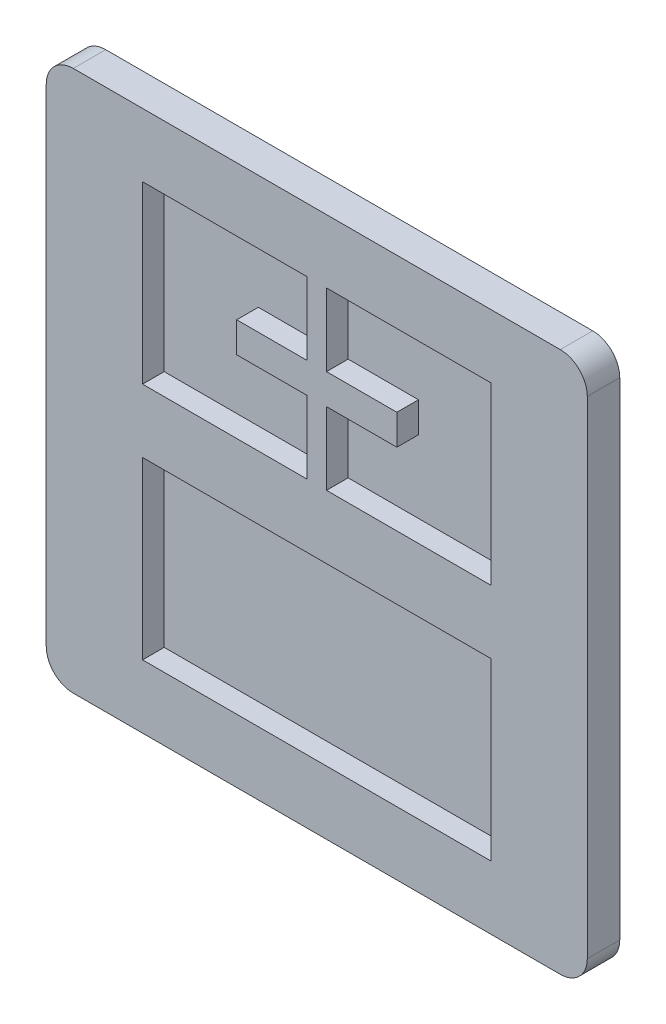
ISO-10303-21;
HEADER;
FILE_DESCRIPTION(('STEP AP214'),'2;1');
FILE_NAME('part.step','',(''),(''),'','','');
FILE_SCHEMA(('AUTOMOTIVE_DESIGN { 1 0 10303 214 1 1 1 1 }'));
ENDSEC;
DATA;
#1=APPLICATION_CONTEXT('core data for automotive mechanical design processes');
#2=APPLICATION_PROTOCOL_DEFINITION('international standard','automotive_design',2000,#1);
#3=PRODUCT_CONTEXT('',#1,'mechanical');
#4=PRODUCT('Part','Part','',(#3));
#5=PRODUCT_RELATED_PRODUCT_CATEGORY('part','',(#4));
#6=PRODUCT_DEFINITION_FORMATION('','',#4);
#7=PRODUCT_DEFINITION_CONTEXT('part definition',#1,'design');
#8=PRODUCT_DEFINITION('design','',#6,#7);
#9=PRODUCT_DEFINITION_SHAPE('','',#8);
#10=(LENGTH_UNIT() NAMED_UNIT(*) SI_UNIT(.MILLI.,.METRE.));
#11=(NAMED_UNIT(*) PLANE_ANGLE_UNIT() SI_UNIT($,.RADIAN.));
#12=(NAMED_UNIT(*) SI_UNIT($,.STERADIAN.) SOLID_ANGLE_UNIT());
#13=UNCERTAINTY_MEASURE_WITH_UNIT(LENGTH_MEASURE(1.E-05),#10,'distance_accuracy_value','');
#14=(GEOMETRIC_REPRESENTATION_CONTEXT(3) GLOBAL_UNCERTAINTY_ASSIGNED_CONTEXT((#13)) GLOBAL_UNIT_ASSIGNED_CONTEXT((#10,
#11,#12)) REPRESENTATION_CONTEXT('',''));
#15=CARTESIAN_POINT('',(0.,0.,0.));
#16=DIRECTION('',(0.,0.,1.));
#17=DIRECTION('',(1.,0.,0.));
#18=AXIS2_PLACEMENT_3D('',#15,#16,#17);
#19=CARTESIAN_POINT('',(50.,-50.,2.));
#20=DIRECTION('',(-1.,0.,0.));
#21=DIRECTION('',(0.,0.,1.));
#22=AXIS2_PLACEMENT_3D('',#19,#20,#21);
#23=PLANE('',#22);
#24=DIRECTION('',(0.,1.,0.));
#25=VECTOR('',#24,1.);
#26=CARTESIAN_POINT('',(50.,0.,6.));
#27=LINE('',#26,#25);
#28=CARTESIAN_POINT('',(50.,-45.,6.));
#29=VERTEX_POINT('',#28);
#30=CARTESIAN_POINT('',(50.,45.,6.));
#31=VERTEX_POINT('',#30);
#32=EDGE_CURVE('E259',#29,#31,#27,.T.);
#33=ORIENTED_EDGE('',*,*,#32,.F.);
#34=DIRECTION('',(0.,0.,-1.));
#35=VECTOR('',#34,1.);
#36=CARTESIAN_POINT('',(50.,-45.,2.));
#37=LINE('',#36,#35);
#38=CARTESIAN_POINT('',(50.,-45.,0.));
#39=VERTEX_POINT('',#38);
#40=EDGE_CURVE('E441',#29,#39,#37,.T.);
#41=ORIENTED_EDGE('',*,*,#40,.T.);
#42=DIRECTION('',(0.,1.,0.));
#43=VECTOR('',#42,1.);
#44=CARTESIAN_POINT('',(50.,-50.,0.));
#45=LINE('',#44,#43);
#46=CARTESIAN_POINT('',(50.,45.,0.));
#47=VERTEX_POINT('',#46);
#48=EDGE_CURVE('E383',#39,#47,#45,.T.);
#49=ORIENTED_EDGE('',*,*,#48,.T.);
#50=DIRECTION('',(0.,0.,-1.));
#51=VECTOR('',#50,1.);
#52=CARTESIAN_POINT('',(50.,45.,2.));
#53=LINE('',#52,#51);
#54=EDGE_CURVE('E439',#47,#31,#53,.F.);
#55=ORIENTED_EDGE('',*,*,#54,.T.);
#56=EDGE_LOOP('',(#33,#41,#49,#55));
#57=FACE_BOUND('',#56,.T.);
#58=ADVANCED_FACE('F38',(#57),#23,.F.);
#59=CARTESIAN_POINT('',(-50.,50.,2.));
#60=DIRECTION('',(0.,-1.,0.));
#61=DIRECTION('',(0.,0.,-1.));
#62=AXIS2_PLACEMENT_3D('',#59,#60,#61);
#63=PLANE('',#62);
#64=DIRECTION('',(-1.,0.,0.));
#65=VECTOR('',#64,1.);
#66=CARTESIAN_POINT('',(0.,50.,6.));
#67=LINE('',#66,#65);
#68=CARTESIAN_POINT('',(45.,50.,6.));
#69=VERTEX_POINT('',#68);
#70=CARTESIAN_POINT('',(-45.,50.,6.));
#71=VERTEX_POINT('',#70);
#72=EDGE_CURVE('E261',#69,#71,#67,.T.);
#73=ORIENTED_EDGE('',*,*,#72,.F.);
#74=DIRECTION('',(0.,0.,-1.));
#75=VECTOR('',#74,1.);
#76=CARTESIAN_POINT('',(45.,50.,2.));
#77=LINE('',#76,#75);
#78=CARTESIAN_POINT('',(45.,50.,0.));
#79=VERTEX_POINT('',#78);
#80=EDGE_CURVE('E11',#69,#79,#77,.T.);
#81=ORIENTED_EDGE('',*,*,#80,.T.);
#82=DIRECTION('',(-1.,0.,0.));
#83=VECTOR('',#82,1.);
#84=CARTESIAN_POINT('',(-50.,50.,0.));
#85=LINE('',#84,#83);
#86=CARTESIAN_POINT('',(-45.,50.,0.));
#87=VERTEX_POINT('',#86);
#88=EDGE_CURVE('E406',#79,#87,#85,.T.);
#89=ORIENTED_EDGE('',*,*,#88,.T.);
#90=DIRECTION('',(0.,0.,-1.));
#91=VECTOR('',#90,1.);
#92=CARTESIAN_POINT('',(-45.,50.,2.));
#93=LINE('',#92,#91);
#94=EDGE_CURVE('E46',#87,#71,#93,.F.);
#95=ORIENTED_EDGE('',*,*,#94,.T.);
#96=EDGE_LOOP('',(#73,#81,#89,#95));
#97=FACE_BOUND('',#96,.T.);
#98=ADVANCED_FACE('F457',(#97),#63,.F.);
#99=CARTESIAN_POINT('',(-50.,-50.,2.));
#100=DIRECTION('',(1.,0.,0.));
#101=DIRECTION('',(0.,0.,-1.));
#102=AXIS2_PLACEMENT_3D('',#99,#100,#101);
#103=PLANE('',#102);
#104=DIRECTION('',(0.,-1.,0.));
#105=VECTOR('',#104,1.);
#106=CARTESIAN_POINT('',(-50.,-50.,0.));
#107=LINE('',#106,#105);
#108=CARTESIAN_POINT('',(-50.,45.,0.));
#109=VERTEX_POINT('',#108);
#110=CARTESIAN_POINT('',(-50.,-45.,0.));
#111=VERTEX_POINT('',#110);
#112=EDGE_CURVE('E408',#109,#111,#107,.T.);
#113=ORIENTED_EDGE('',*,*,#112,.T.);
#114=DIRECTION('',(0.,0.,-1.));
#115=VECTOR('',#114,1.);
#116=CARTESIAN_POINT('',(-50.,-45.,2.));
#117=LINE('',#116,#115);
#118=CARTESIAN_POINT('',(-50.,-45.,6.));
#119=VERTEX_POINT('',#118);
#120=EDGE_CURVE('E430',#111,#119,#117,.F.);
#121=ORIENTED_EDGE('',*,*,#120,.T.);
#122=DIRECTION('',(0.,-1.,0.));
#123=VECTOR('',#122,1.);
#124=CARTESIAN_POINT('',(-50.,0.,6.));
#125=LINE('',#124,#123);
#126=CARTESIAN_POINT('',(-50.,45.,6.));
#127=VERTEX_POINT('',#126);
#128=EDGE_CURVE('E263',#127,#119,#125,.T.);
#129=ORIENTED_EDGE('',*,*,#128,.F.);
#130=DIRECTION('',(0.,0.,-1.));
#131=VECTOR('',#130,1.);
#132=CARTESIAN_POINT('',(-50.,45.,2.));
#133=LINE('',#132,#131);
#134=EDGE_CURVE('E427',#127,#109,#133,.T.);
#135=ORIENTED_EDGE('',*,*,#134,.T.);
#136=EDGE_LOOP('',(#113,#121,#129,#135));
#137=FACE_BOUND('',#136,.T.);
#138=ADVANCED_FACE('F465',(#137),#103,.F.);
#139=CARTESIAN_POINT('',(-50.,-50.,2.));
#140=DIRECTION('',(0.,1.,0.));
#141=DIRECTION('',(0.,0.,1.));
#142=AXIS2_PLACEMENT_3D('',#139,#140,#141);
#143=PLANE('',#142);
#144=DIRECTION('',(1.,0.,0.));
#145=VECTOR('',#144,1.);
#146=CARTESIAN_POINT('',(0.,-50.,6.));
#147=LINE('',#146,#145);
#148=CARTESIAN_POINT('',(-45.,-50.,6.));
#149=VERTEX_POINT('',#148);
#150=CARTESIAN_POINT('',(45.,-50.,6.));
#151=VERTEX_POINT('',#150);
#152=EDGE_CURVE('E256',#149,#151,#147,.T.);
#153=ORIENTED_EDGE('',*,*,#152,.F.);
#154=DIRECTION('',(0.,0.,-1.));
#155=VECTOR('',#154,1.);
#156=CARTESIAN_POINT('',(-45.,-50.,2.));
#157=LINE('',#156,#155);
#158=CARTESIAN_POINT('',(-45.,-50.,0.));
#159=VERTEX_POINT('',#158);
#160=EDGE_CURVE('E416',#149,#159,#157,.T.);
#161=ORIENTED_EDGE('',*,*,#160,.T.);
#162=DIRECTION('',(1.,0.,0.));
#163=VECTOR('',#162,1.);
#164=CARTESIAN_POINT('',(-50.,-50.,0.));
#165=LINE('',#164,#163);
#166=CARTESIAN_POINT('',(45.,-50.,0.));
#167=VERTEX_POINT('',#166);
#168=EDGE_CURVE('E411',#159,#167,#165,.T.);
#169=ORIENTED_EDGE('',*,*,#168,.T.);
#170=DIRECTION('',(0.,0.,-1.));
#171=VECTOR('',#170,1.);
#172=CARTESIAN_POINT('',(45.,-50.,2.));
#173=LINE('',#172,#171);
#174=EDGE_CURVE('E414',#167,#151,#173,.F.);
#175=ORIENTED_EDGE('',*,*,#174,.T.);
#176=EDGE_LOOP('',(#153,#161,#169,#175));
#177=FACE_BOUND('',#176,.T.);
#178=ADVANCED_FACE('F473',(#177),#143,.F.);
#179=CARTESIAN_POINT('',(0.,0.,0.));
#180=DIRECTION('',(0.,0.,-1.));
#181=DIRECTION('',(-1.,0.,0.));
#182=AXIS2_PLACEMENT_3D('',#179,#180,#181);
#183=PLANE('',#182);
#184=ORIENTED_EDGE('',*,*,#168,.F.);
#185=CARTESIAN_POINT('',(-45.,-45.,0.));
#186=DIRECTION('',(0.,0.,-1.));
#187=DIRECTION('',(-1.,0.,0.));
#188=AXIS2_PLACEMENT_3D('',#185,#186,#187);
#189=CIRCLE('',#188,5.);
#190=EDGE_CURVE('E425',#159,#111,#189,.T.);
#191=ORIENTED_EDGE('',*,*,#190,.T.);
#192=ORIENTED_EDGE('',*,*,#112,.F.);
#193=CARTESIAN_POINT('',(-45.,45.,0.));
#194=DIRECTION('',(0.,0.,-1.));
#195=DIRECTION('',(-1.,0.,0.));
#196=AXIS2_PLACEMENT_3D('',#193,#194,#195);
#197=CIRCLE('',#196,5.);
#198=EDGE_CURVE('E419',#109,#87,#197,.T.);
#199=ORIENTED_EDGE('',*,*,#198,.T.);
#200=ORIENTED_EDGE('',*,*,#88,.F.);
#201=CARTESIAN_POINT('',(45.,45.,0.));
#202=DIRECTION('',(0.,0.,-1.));
#203=DIRECTION('',(-1.,0.,0.));
#204=AXIS2_PLACEMENT_3D('',#201,#202,#203);
#205=CIRCLE('',#204,5.);
#206=EDGE_CURVE('E421',#79,#47,#205,.T.);
#207=ORIENTED_EDGE('',*,*,#206,.T.);
#208=ORIENTED_EDGE('',*,*,#48,.F.);
#209=CARTESIAN_POINT('',(45.,-45.,0.));
#210=DIRECTION('',(0.,0.,-1.));
#211=DIRECTION('',(-1.,0.,0.));
#212=AXIS2_PLACEMENT_3D('',#209,#210,#211);
#213=CIRCLE('',#212,5.);
#214=EDGE_CURVE('E423',#39,#167,#213,.T.);
#215=ORIENTED_EDGE('',*,*,#214,.T.);
#216=EDGE_LOOP('',(#184,#191,#192,#199,#200,#207,#208,#215));
#217=FACE_BOUND('',#216,.T.);
#218=ADVANCED_FACE('F452',(#217),#183,.T.);
#219=CARTESIAN_POINT('',(0.,5.86666666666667,6.));
#220=DIRECTION('',(0.,-1.,0.));
#221=DIRECTION('',(1.,0.,0.));
#222=AXIS2_PLACEMENT_3D('',#219,#220,#221);
#223=PLANE('',#222);
#224=DIRECTION('',(-1.,0.,0.));
#225=VECTOR('',#224,1.);
#226=CARTESIAN_POINT('',(0.,5.86666666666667,2.));
#227=LINE('',#226,#225);
#228=CARTESIAN_POINT('',(32.2,5.86666666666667,2.));
#229=VERTEX_POINT('',#228);
#230=CARTESIAN_POINT('',(1.8,5.86666666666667,2.));
#231=VERTEX_POINT('',#230);
#232=EDGE_CURVE('E341',#229,#231,#227,.T.);
#233=ORIENTED_EDGE('',*,*,#232,.T.);
#234=DIRECTION('',(0.,0.,-1.));
#235=VECTOR('',#234,1.);
#236=CARTESIAN_POINT('',(1.8,5.86666666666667,6.));
#237=LINE('',#236,#235);
#238=CARTESIAN_POINT('',(1.8,5.86666666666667,6.));
#239=VERTEX_POINT('',#238);
#240=EDGE_CURVE('E380',#239,#231,#237,.T.);
#241=ORIENTED_EDGE('',*,*,#240,.F.);
#242=DIRECTION('',(-1.,0.,0.));
#243=VECTOR('',#242,1.);
#244=CARTESIAN_POINT('',(0.,5.86666666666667,6.));
#245=LINE('',#244,#243);
#246=CARTESIAN_POINT('',(32.2,5.86666666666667,6.));
#247=VERTEX_POINT('',#246);
#248=EDGE_CURVE('E289',#247,#239,#245,.T.);
#249=ORIENTED_EDGE('',*,*,#248,.F.);
#250=DIRECTION('',(0.,0.,-1.));
#251=VECTOR('',#250,1.);
#252=CARTESIAN_POINT('',(32.2,5.86666666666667,6.));
#253=LINE('',#252,#251);
#254=EDGE_CURVE('E358',#247,#229,#253,.T.);
#255=ORIENTED_EDGE('',*,*,#254,.T.);
#256=EDGE_LOOP('',(#233,#241,#249,#255));
#257=FACE_BOUND('',#256,.T.);
#258=ADVANCED_FACE('F497',(#257),#223,.F.);
#259=CARTESIAN_POINT('',(1.8,0.,6.));
#260=DIRECTION('',(-1.,0.,0.));
#261=DIRECTION('',(0.,-1.,0.));
#262=AXIS2_PLACEMENT_3D('',#259,#260,#261);
#263=PLANE('',#262);
#264=DIRECTION('',(0.,1.,0.));
#265=VECTOR('',#264,1.);
#266=CARTESIAN_POINT('',(1.8,0.,2.));
#267=LINE('',#266,#265);
#268=CARTESIAN_POINT('',(1.8,19.2666666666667,2.));
#269=VERTEX_POINT('',#268);
#270=EDGE_CURVE('E344',#231,#269,#267,.T.);
#271=ORIENTED_EDGE('',*,*,#270,.T.);
#272=DIRECTION('',(0.,0.,-1.));
#273=VECTOR('',#272,1.);
#274=CARTESIAN_POINT('',(1.8,19.2666666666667,6.));
#275=LINE('',#274,#273);
#276=CARTESIAN_POINT('',(1.8,19.2666666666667,6.));
#277=VERTEX_POINT('',#276);
#278=EDGE_CURVE('E377',#277,#269,#275,.T.);
#279=ORIENTED_EDGE('',*,*,#278,.F.);
#280=DIRECTION('',(0.,1.,0.));
#281=VECTOR('',#280,1.);
#282=CARTESIAN_POINT('',(1.8,0.,6.));
#283=LINE('',#282,#281);
#284=EDGE_CURVE('E292',#239,#277,#283,.T.);
#285=ORIENTED_EDGE('',*,*,#284,.F.);
#286=ORIENTED_EDGE('',*,*,#240,.T.);
#287=EDGE_LOOP('',(#271,#279,#285,#286));
#288=FACE_BOUND('',#287,.T.);
#289=ADVANCED_FACE('F551',(#288),#263,.F.);
#290=CARTESIAN_POINT('',(0.,19.2666666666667,6.));
#291=DIRECTION('',(0.,1.,0.));
#292=DIRECTION('',(-1.,0.,0.));
#293=AXIS2_PLACEMENT_3D('',#290,#291,#292);
#294=PLANE('',#293);
#295=DIRECTION('',(1.,0.,0.));
#296=VECTOR('',#295,1.);
#297=CARTESIAN_POINT('',(0.,19.2666666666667,2.));
#298=LINE('',#297,#296);
#299=CARTESIAN_POINT('',(14.8,19.2666666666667,2.));
#300=VERTEX_POINT('',#299);
#301=EDGE_CURVE('E347',#269,#300,#298,.T.);
#302=ORIENTED_EDGE('',*,*,#301,.T.);
#303=DIRECTION('',(0.,0.,-1.));
#304=VECTOR('',#303,1.);
#305=CARTESIAN_POINT('',(14.8,19.2666666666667,6.));
#306=LINE('',#305,#304);
#307=CARTESIAN_POINT('',(14.8,19.2666666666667,6.));
#308=VERTEX_POINT('',#307);
#309=EDGE_CURVE('E374',#308,#300,#306,.T.);
#310=ORIENTED_EDGE('',*,*,#309,.F.);
#311=DIRECTION('',(1.,0.,0.));
#312=VECTOR('',#311,1.);
#313=CARTESIAN_POINT('',(0.,19.2666666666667,6.));
#314=LINE('',#313,#312);
#315=EDGE_CURVE('E294',#277,#308,#314,.T.);
#316=ORIENTED_EDGE('',*,*,#315,.F.);
#317=ORIENTED_EDGE('',*,*,#278,.T.);
#318=EDGE_LOOP('',(#302,#310,#316,#317));
#319=FACE_BOUND('',#318,.T.);
#320=ADVANCED_FACE('F555',(#319),#294,.F.);
#321=CARTESIAN_POINT('',(14.8,0.,6.));
#322=DIRECTION('',(-1.,0.,0.));
#323=DIRECTION('',(0.,0.,1.));
#324=AXIS2_PLACEMENT_3D('',#321,#322,#323);
#325=PLANE('',#324);
#326=DIRECTION('',(0.,1.,0.));
#327=VECTOR('',#326,1.);
#328=CARTESIAN_POINT('',(14.8,0.,2.));
#329=LINE('',#328,#327);
#330=CARTESIAN_POINT('',(14.8,24.8666666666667,2.));
#331=VERTEX_POINT('',#330);
#332=EDGE_CURVE('E350',#300,#331,#329,.T.);
#333=ORIENTED_EDGE('',*,*,#332,.T.);
#334=DIRECTION('',(0.,0.,-1.));
#335=VECTOR('',#334,1.);
#336=CARTESIAN_POINT('',(14.8,24.8666666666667,6.));
#337=LINE('',#336,#335);
#338=CARTESIAN_POINT('',(14.8,24.8666666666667,6.));
#339=VERTEX_POINT('',#338);
#340=EDGE_CURVE('E371',#339,#331,#337,.T.);
#341=ORIENTED_EDGE('',*,*,#340,.F.);
#342=DIRECTION('',(0.,1.,0.));
#343=VECTOR('',#342,1.);
#344=CARTESIAN_POINT('',(14.8,0.,6.));
#345=LINE('',#344,#343);
#346=EDGE_CURVE('E296',#308,#339,#345,.T.);
#347=ORIENTED_EDGE('',*,*,#346,.F.);
#348=ORIENTED_EDGE('',*,*,#309,.T.);
#349=EDGE_LOOP('',(#333,#341,#347,#348));
#350=FACE_BOUND('',#349,.T.);
#351=ADVANCED_FACE('F559',(#350),#325,.F.);
#352=CARTESIAN_POINT('',(0.,24.8666666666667,6.));
#353=DIRECTION('',(0.,1.,0.));
#354=DIRECTION('',(-1.,0.,0.));
#355=AXIS2_PLACEMENT_3D('',#352,#353,#354);
#356=PLANE('',#355);
#357=DIRECTION('',(1.,0.,0.));
#358=VECTOR('',#357,1.);
#359=CARTESIAN_POINT('',(0.,24.8666666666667,2.));
#360=LINE('',#359,#358);
#361=CARTESIAN_POINT('',(1.8,24.8666666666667,2.));
#362=VERTEX_POINT('',#361);
#363=EDGE_CURVE('E353',#362,#331,#360,.T.);
#364=ORIENTED_EDGE('',*,*,#363,.F.);
#365=DIRECTION('',(0.,0.,-1.));
#366=VECTOR('',#365,1.);
#367=CARTESIAN_POINT('',(1.8,24.8666666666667,6.));
#368=LINE('',#367,#366);
#369=CARTESIAN_POINT('',(1.8,24.8666666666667,6.));
#370=VERTEX_POINT('',#369);
#371=EDGE_CURVE('E368',#370,#362,#368,.T.);
#372=ORIENTED_EDGE('',*,*,#371,.F.);
#373=DIRECTION('',(1.,0.,0.));
#374=VECTOR('',#373,1.);
#375=CARTESIAN_POINT('',(0.,24.8666666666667,6.));
#376=LINE('',#375,#374);
#377=EDGE_CURVE('E298',#370,#339,#376,.T.);
#378=ORIENTED_EDGE('',*,*,#377,.T.);
#379=ORIENTED_EDGE('',*,*,#340,.T.);
#380=EDGE_LOOP('',(#364,#372,#378,#379));
#381=FACE_BOUND('',#380,.T.);
#382=ADVANCED_FACE('F563',(#381),#356,.T.);
#383=CARTESIAN_POINT('',(1.8,0.,6.));
#384=DIRECTION('',(1.,0.,0.));
#385=DIRECTION('',(0.,1.,0.));
#386=AXIS2_PLACEMENT_3D('',#383,#384,#385);
#387=PLANE('',#386);
#388=DIRECTION('',(0.,-1.,0.));
#389=VECTOR('',#388,1.);
#390=CARTESIAN_POINT('',(1.8,0.,2.));
#391=LINE('',#390,#389);
#392=CARTESIAN_POINT('',(1.8,38.2666666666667,2.));
#393=VERTEX_POINT('',#392);
#394=EDGE_CURVE('E355',#393,#362,#391,.T.);
#395=ORIENTED_EDGE('',*,*,#394,.F.);
#396=DIRECTION('',(0.,0.,-1.));
#397=VECTOR('',#396,1.);
#398=CARTESIAN_POINT('',(1.8,38.2666666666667,6.));
#399=LINE('',#398,#397);
#400=CARTESIAN_POINT('',(1.8,38.2666666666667,6.));
#401=VERTEX_POINT('',#400);
#402=EDGE_CURVE('E365',#401,#393,#399,.T.);
#403=ORIENTED_EDGE('',*,*,#402,.F.);
#404=DIRECTION('',(0.,-1.,0.));
#405=VECTOR('',#404,1.);
#406=CARTESIAN_POINT('',(1.8,0.,6.));
#407=LINE('',#406,#405);
#408=EDGE_CURVE('E301',#401,#370,#407,.T.);
#409=ORIENTED_EDGE('',*,*,#408,.T.);
#410=ORIENTED_EDGE('',*,*,#371,.T.);
#411=EDGE_LOOP('',(#395,#403,#409,#410));
#412=FACE_BOUND('',#411,.T.);
#413=ADVANCED_FACE('F567',(#412),#387,.T.);
#414=CARTESIAN_POINT('',(0.,38.2666666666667,6.));
#415=DIRECTION('',(0.,-1.,0.));
#416=DIRECTION('',(0.,0.,-1.));
#417=AXIS2_PLACEMENT_3D('',#414,#415,#416);
#418=PLANE('',#417);
#419=DIRECTION('',(-1.,0.,0.));
#420=VECTOR('',#419,1.);
#421=CARTESIAN_POINT('',(0.,38.2666666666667,2.));
#422=LINE('',#421,#420);
#423=CARTESIAN_POINT('',(32.2,38.2666666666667,2.));
#424=VERTEX_POINT('',#423);
#425=EDGE_CURVE('E251',#424,#393,#422,.T.);
#426=ORIENTED_EDGE('',*,*,#425,.F.);
#427=DIRECTION('',(0.,0.,-1.));
#428=VECTOR('',#427,1.);
#429=CARTESIAN_POINT('',(32.2,38.2666666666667,6.));
#430=LINE('',#429,#428);
#431=CARTESIAN_POINT('',(32.2,38.2666666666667,6.));
#432=VERTEX_POINT('',#431);
#433=EDGE_CURVE('E361',#432,#424,#430,.T.);
#434=ORIENTED_EDGE('',*,*,#433,.F.);
#435=DIRECTION('',(-1.,0.,0.));
#436=VECTOR('',#435,1.);
#437=CARTESIAN_POINT('',(0.,38.2666666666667,6.));
#438=LINE('',#437,#436);
#439=EDGE_CURVE('E304',#432,#401,#438,.T.);
#440=ORIENTED_EDGE('',*,*,#439,.T.);
#441=ORIENTED_EDGE('',*,*,#402,.T.);
#442=EDGE_LOOP('',(#426,#434,#440,#441));
#443=FACE_BOUND('',#442,.T.);
#444=ADVANCED_FACE('F522',(#443),#418,.T.);
#445=CARTESIAN_POINT('',(0.,19.2666666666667,6.));
#446=DIRECTION('',(0.,-1.,0.));
#447=DIRECTION('',(0.,0.,-1.));
#448=AXIS2_PLACEMENT_3D('',#445,#446,#447);
#449=PLANE('',#448);
#450=DIRECTION('',(-1.,0.,0.));
#451=VECTOR('',#450,1.);
#452=CARTESIAN_POINT('',(0.,19.2666666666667,2.));
#453=LINE('',#452,#451);
#454=CARTESIAN_POINT('',(-1.8,19.2666666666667,2.));
#455=VERTEX_POINT('',#454);
#456=CARTESIAN_POINT('',(-14.8,19.2666666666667,2.));
#457=VERTEX_POINT('',#456);
#458=EDGE_CURVE('E318',#455,#457,#453,.T.);
#459=ORIENTED_EDGE('',*,*,#458,.F.);
#460=DIRECTION('',(0.,0.,-1.));
#461=VECTOR('',#460,1.);
#462=CARTESIAN_POINT('',(-1.8,19.2666666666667,6.));
#463=LINE('',#462,#461);
#464=CARTESIAN_POINT('',(-1.8,19.2666666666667,6.));
#465=VERTEX_POINT('',#464);
#466=EDGE_CURVE('E362',#465,#455,#463,.T.);
#467=ORIENTED_EDGE('',*,*,#466,.F.);
#468=DIRECTION('',(-1.,0.,0.));
#469=VECTOR('',#468,1.);
#470=CARTESIAN_POINT('',(0.,19.2666666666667,6.));
#471=LINE('',#470,#469);
#472=CARTESIAN_POINT('',(-14.8,19.2666666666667,6.));
#473=VERTEX_POINT('',#472);
#474=EDGE_CURVE('E266',#465,#473,#471,.T.);
#475=ORIENTED_EDGE('',*,*,#474,.T.);
#476=DIRECTION('',(0.,0.,-1.));
#477=VECTOR('',#476,1.);
#478=CARTESIAN_POINT('',(-14.8,19.2666666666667,6.));
#479=LINE('',#478,#477);
#480=EDGE_CURVE('E234',#473,#457,#479,.T.);
#481=ORIENTED_EDGE('',*,*,#480,.T.);
#482=EDGE_LOOP('',(#459,#467,#475,#481));
#483=FACE_BOUND('',#482,.T.);
#484=ADVANCED_FACE('F518',(#483),#449,.T.);
#485=CARTESIAN_POINT('',(-1.8,0.,6.));
#486=DIRECTION('',(-1.,0.,0.));
#487=DIRECTION('',(0.,0.,1.));
#488=AXIS2_PLACEMENT_3D('',#485,#486,#487);
#489=PLANE('',#488);
#490=DIRECTION('',(0.,1.,0.));
#491=VECTOR('',#490,1.);
#492=CARTESIAN_POINT('',(-1.8,0.,2.));
#493=LINE('',#492,#491);
#494=CARTESIAN_POINT('',(-1.8,5.86666666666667,2.));
#495=VERTEX_POINT('',#494);
#496=EDGE_CURVE('E321',#495,#455,#493,.T.);
#497=ORIENTED_EDGE('',*,*,#496,.F.);
#498=DIRECTION('',(0.,0.,-1.));
#499=VECTOR('',#498,1.);
#500=CARTESIAN_POINT('',(-1.8,5.86666666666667,6.));
#501=LINE('',#500,#499);
#502=CARTESIAN_POINT('',(-1.8,5.86666666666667,6.));
#503=VERTEX_POINT('',#502);
#504=EDGE_CURVE('E396',#503,#495,#501,.T.);
#505=ORIENTED_EDGE('',*,*,#504,.F.);
#506=DIRECTION('',(0.,1.,0.));
#507=VECTOR('',#506,1.);
#508=CARTESIAN_POINT('',(-1.8,0.,6.));
#509=LINE('',#508,#507);
#510=EDGE_CURVE('E269',#503,#465,#509,.T.);
#511=ORIENTED_EDGE('',*,*,#510,.T.);
#512=ORIENTED_EDGE('',*,*,#466,.T.);
#513=EDGE_LOOP('',(#497,#505,#511,#512));
#514=FACE_BOUND('',#513,.T.);
#515=ADVANCED_FACE('F521',(#514),#489,.T.);
#516=CARTESIAN_POINT('',(0.,5.86666666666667,6.));
#517=DIRECTION('',(0.,1.,0.));
#518=DIRECTION('',(0.,0.,1.));
#519=AXIS2_PLACEMENT_3D('',#516,#517,#518);
#520=PLANE('',#519);
#521=DIRECTION('',(1.,0.,0.));
#522=VECTOR('',#521,1.);
#523=CARTESIAN_POINT('',(0.,5.86666666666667,2.));
#524=LINE('',#523,#522);
#525=CARTESIAN_POINT('',(-32.2,5.86666666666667,2.));
#526=VERTEX_POINT('',#525);
#527=EDGE_CURVE('E324',#526,#495,#524,.T.);
#528=ORIENTED_EDGE('',*,*,#527,.F.);
#529=DIRECTION('',(0.,0.,-1.));
#530=VECTOR('',#529,1.);
#531=CARTESIAN_POINT('',(-32.2,5.86666666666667,6.));
#532=LINE('',#531,#530);
#533=CARTESIAN_POINT('',(-32.2,5.86666666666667,6.));
#534=VERTEX_POINT('',#533);
#535=EDGE_CURVE('E394',#534,#526,#532,.T.);
#536=ORIENTED_EDGE('',*,*,#535,.F.);
#537=DIRECTION('',(1.,0.,0.));
#538=VECTOR('',#537,1.);
#539=CARTESIAN_POINT('',(0.,5.86666666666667,6.));
#540=LINE('',#539,#538);
#541=EDGE_CURVE('E272',#534,#503,#540,.T.);
#542=ORIENTED_EDGE('',*,*,#541,.T.);
#543=ORIENTED_EDGE('',*,*,#504,.T.);
#544=EDGE_LOOP('',(#528,#536,#542,#543));
#545=FACE_BOUND('',#544,.T.);
#546=ADVANCED_FACE('F526',(#545),#520,.T.);
#547=CARTESIAN_POINT('',(-32.2,0.,6.));
#548=DIRECTION('',(1.,0.,0.));
#549=DIRECTION('',(0.,0.,-1.));
#550=AXIS2_PLACEMENT_3D('',#547,#548,#549);
#551=PLANE('',#550);
#552=DIRECTION('',(0.,-1.,0.));
#553=VECTOR('',#552,1.);
#554=CARTESIAN_POINT('',(-32.2,0.,2.));
#555=LINE('',#554,#553);
#556=CARTESIAN_POINT('',(-32.2,38.2666666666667,2.));
#557=VERTEX_POINT('',#556);
#558=EDGE_CURVE('E327',#557,#526,#555,.T.);
#559=ORIENTED_EDGE('',*,*,#558,.F.);
#560=DIRECTION('',(0.,0.,-1.));
#561=VECTOR('',#560,1.);
#562=CARTESIAN_POINT('',(-32.2,38.2666666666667,6.));
#563=LINE('',#562,#561);
#564=CARTESIAN_POINT('',(-32.2,38.2666666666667,6.));
#565=VERTEX_POINT('',#564);
#566=EDGE_CURVE('E392',#565,#557,#563,.T.);
#567=ORIENTED_EDGE('',*,*,#566,.F.);
#568=DIRECTION('',(0.,-1.,0.));
#569=VECTOR('',#568,1.);
#570=CARTESIAN_POINT('',(-32.2,0.,6.));
#571=LINE('',#570,#569);
#572=EDGE_CURVE('E275',#565,#534,#571,.T.);
#573=ORIENTED_EDGE('',*,*,#572,.T.);
#574=ORIENTED_EDGE('',*,*,#535,.T.);
#575=EDGE_LOOP('',(#559,#567,#573,#574));
#576=FACE_BOUND('',#575,.T.);
#577=ADVANCED_FACE('F530',(#576),#551,.T.);
#578=CARTESIAN_POINT('',(0.,38.2666666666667,6.));
#579=DIRECTION('',(0.,1.,0.));
#580=DIRECTION('',(0.,0.,1.));
#581=AXIS2_PLACEMENT_3D('',#578,#579,#580);
#582=PLANE('',#581);
#583=DIRECTION('',(1.,0.,0.));
#584=VECTOR('',#583,1.);
#585=CARTESIAN_POINT('',(0.,38.2666666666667,2.));
#586=LINE('',#585,#584);
#587=CARTESIAN_POINT('',(-1.8,38.2666666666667,2.));
#588=VERTEX_POINT('',#587);
#589=EDGE_CURVE('E330',#557,#588,#586,.T.);
#590=ORIENTED_EDGE('',*,*,#589,.T.);
#591=DIRECTION('',(0.,0.,-1.));
#592=VECTOR('',#591,1.);
#593=CARTESIAN_POINT('',(-1.8,38.2666666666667,6.));
#594=LINE('',#593,#592);
#595=CARTESIAN_POINT('',(-1.8,38.2666666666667,6.));
#596=VERTEX_POINT('',#595);
#597=EDGE_CURVE('E390',#596,#588,#594,.T.);
#598=ORIENTED_EDGE('',*,*,#597,.F.);
#599=DIRECTION('',(1.,0.,0.));
#600=VECTOR('',#599,1.);
#601=CARTESIAN_POINT('',(0.,38.2666666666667,6.));
#602=LINE('',#601,#600);
#603=EDGE_CURVE('E278',#565,#596,#602,.T.);
#604=ORIENTED_EDGE('',*,*,#603,.F.);
#605=ORIENTED_EDGE('',*,*,#566,.T.);
#606=EDGE_LOOP('',(#590,#598,#604,#605));
#607=FACE_BOUND('',#606,.T.);
#608=ADVANCED_FACE('F534',(#607),#582,.F.);
#609=CARTESIAN_POINT('',(-1.8,0.,6.));
#610=DIRECTION('',(1.,0.,0.));
#611=DIRECTION('',(0.,1.,0.));
#612=AXIS2_PLACEMENT_3D('',#609,#610,#611);
#613=PLANE('',#612);
#614=DIRECTION('',(0.,-1.,0.));
#615=VECTOR('',#614,1.);
#616=CARTESIAN_POINT('',(-1.8,0.,2.));
#617=LINE('',#616,#615);
#618=CARTESIAN_POINT('',(-1.8,24.8666666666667,2.));
#619=VERTEX_POINT('',#618);
#620=EDGE_CURVE('E333',#588,#619,#617,.T.);
#621=ORIENTED_EDGE('',*,*,#620,.T.);
#622=DIRECTION('',(0.,0.,-1.));
#623=VECTOR('',#622,1.);
#624=CARTESIAN_POINT('',(-1.8,24.8666666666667,6.));
#625=LINE('',#624,#623);
#626=CARTESIAN_POINT('',(-1.8,24.8666666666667,6.));
#627=VERTEX_POINT('',#626);
#628=EDGE_CURVE('E388',#627,#619,#625,.T.);
#629=ORIENTED_EDGE('',*,*,#628,.F.);
#630=DIRECTION('',(0.,-1.,0.));
#631=VECTOR('',#630,1.);
#632=CARTESIAN_POINT('',(-1.8,0.,6.));
#633=LINE('',#632,#631);
#634=EDGE_CURVE('E281',#596,#627,#633,.T.);
#635=ORIENTED_EDGE('',*,*,#634,.F.);
#636=ORIENTED_EDGE('',*,*,#597,.T.);
#637=EDGE_LOOP('',(#621,#629,#635,#636));
#638=FACE_BOUND('',#637,.T.);
#639=ADVANCED_FACE('F538',(#638),#613,.F.);
#640=CARTESIAN_POINT('',(0.,24.8666666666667,6.));
#641=DIRECTION('',(0.,-1.,0.));
#642=DIRECTION('',(0.,0.,-1.));
#643=AXIS2_PLACEMENT_3D('',#640,#641,#642);
#644=PLANE('',#643);
#645=DIRECTION('',(-1.,0.,0.));
#646=VECTOR('',#645,1.);
#647=CARTESIAN_POINT('',(0.,24.8666666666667,2.));
#648=LINE('',#647,#646);
#649=CARTESIAN_POINT('',(-14.8,24.8666666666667,2.));
#650=VERTEX_POINT('',#649);
#651=EDGE_CURVE('E336',#619,#650,#648,.T.);
#652=ORIENTED_EDGE('',*,*,#651,.T.);
#653=DIRECTION('',(0.,0.,-1.));
#654=VECTOR('',#653,1.);
#655=CARTESIAN_POINT('',(-14.8,24.8666666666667,6.));
#656=LINE('',#655,#654);
#657=CARTESIAN_POINT('',(-14.8,24.8666666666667,6.));
#658=VERTEX_POINT('',#657);
#659=EDGE_CURVE('E385',#658,#650,#656,.T.);
#660=ORIENTED_EDGE('',*,*,#659,.F.);
#661=DIRECTION('',(-1.,0.,0.));
#662=VECTOR('',#661,1.);
#663=CARTESIAN_POINT('',(0.,24.8666666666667,6.));
#664=LINE('',#663,#662);
#665=EDGE_CURVE('E284',#627,#658,#664,.T.);
#666=ORIENTED_EDGE('',*,*,#665,.F.);
#667=ORIENTED_EDGE('',*,*,#628,.T.);
#668=EDGE_LOOP('',(#652,#660,#666,#667));
#669=FACE_BOUND('',#668,.T.);
#670=ADVANCED_FACE('F505',(#669),#644,.F.);
#671=CARTESIAN_POINT('',(0.,-38.2666666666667,6.));
#672=DIRECTION('',(0.,1.,0.));
#673=DIRECTION('',(0.,0.,1.));
#674=AXIS2_PLACEMENT_3D('',#671,#672,#673);
#675=PLANE('',#674);
#676=DIRECTION('',(1.,0.,0.));
#677=VECTOR('',#676,1.);
#678=CARTESIAN_POINT('',(0.,-38.2666666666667,2.));
#679=LINE('',#678,#677);
#680=CARTESIAN_POINT('',(-32.2,-38.2666666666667,2.));
#681=VERTEX_POINT('',#680);
#682=CARTESIAN_POINT('',(32.2,-38.2666666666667,2.));
#683=VERTEX_POINT('',#682);
#684=EDGE_CURVE('E231',#681,#683,#679,.T.);
#685=ORIENTED_EDGE('',*,*,#684,.F.);
#686=DIRECTION('',(0.,0.,-1.));
#687=VECTOR('',#686,1.);
#688=CARTESIAN_POINT('',(-32.2,-38.2666666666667,6.));
#689=LINE('',#688,#687);
#690=CARTESIAN_POINT('',(-32.2,-38.2666666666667,6.));
#691=VERTEX_POINT('',#690);
#692=EDGE_CURVE('E224',#691,#681,#689,.T.);
#693=ORIENTED_EDGE('',*,*,#692,.F.);
#694=DIRECTION('',(1.,0.,0.));
#695=VECTOR('',#694,1.);
#696=CARTESIAN_POINT('',(0.,-38.2666666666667,6.));
#697=LINE('',#696,#695);
#698=CARTESIAN_POINT('',(32.2,-38.2666666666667,6.));
#699=VERTEX_POINT('',#698);
#700=EDGE_CURVE('E228',#691,#699,#697,.T.);
#701=ORIENTED_EDGE('',*,*,#700,.T.);
#702=DIRECTION('',(0.,0.,-1.));
#703=VECTOR('',#702,1.);
#704=CARTESIAN_POINT('',(32.2,-38.2666666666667,6.));
#705=LINE('',#704,#703);
#706=EDGE_CURVE('E309',#699,#683,#705,.T.);
#707=ORIENTED_EDGE('',*,*,#706,.T.);
#708=EDGE_LOOP('',(#685,#693,#701,#707));
#709=FACE_BOUND('',#708,.T.);
#710=ADVANCED_FACE('F226',(#709),#675,.T.);
#711=CARTESIAN_POINT('',(-32.2,0.,6.));
#712=DIRECTION('',(-1.,0.,0.));
#713=DIRECTION('',(0.,0.,1.));
#714=AXIS2_PLACEMENT_3D('',#711,#712,#713);
#715=PLANE('',#714);
#716=DIRECTION('',(0.,1.,0.));
#717=VECTOR('',#716,1.);
#718=CARTESIAN_POINT('',(-32.2,0.,2.));
#719=LINE('',#718,#717);
#720=CARTESIAN_POINT('',(-32.2,-5.86666666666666,2.));
#721=VERTEX_POINT('',#720);
#722=EDGE_CURVE('E311',#681,#721,#719,.T.);
#723=ORIENTED_EDGE('',*,*,#722,.T.);
#724=DIRECTION('',(0.,0.,-1.));
#725=VECTOR('',#724,1.);
#726=CARTESIAN_POINT('',(-32.2,-5.86666666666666,6.));
#727=LINE('',#726,#725);
#728=CARTESIAN_POINT('',(-32.2,-5.86666666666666,6.));
#729=VERTEX_POINT('',#728);
#730=EDGE_CURVE('E235',#729,#721,#727,.T.);
#731=ORIENTED_EDGE('',*,*,#730,.F.);
#732=DIRECTION('',(0.,1.,0.));
#733=VECTOR('',#732,1.);
#734=CARTESIAN_POINT('',(-32.2,0.,6.));
#735=LINE('',#734,#733);
#736=EDGE_CURVE('E238',#691,#729,#735,.T.);
#737=ORIENTED_EDGE('',*,*,#736,.F.);
#738=ORIENTED_EDGE('',*,*,#692,.T.);
#739=EDGE_LOOP('',(#723,#731,#737,#738));
#740=FACE_BOUND('',#739,.T.);
#741=ADVANCED_FACE('F239',(#740),#715,.F.);
#742=CARTESIAN_POINT('',(0.,-5.86666666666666,6.));
#743=DIRECTION('',(0.,1.,0.));
#744=DIRECTION('',(-1.,0.,0.));
#745=AXIS2_PLACEMENT_3D('',#742,#743,#744);
#746=PLANE('',#745);
#747=DIRECTION('',(1.,0.,0.));
#748=VECTOR('',#747,1.);
#749=CARTESIAN_POINT('',(0.,-5.86666666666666,2.));
#750=LINE('',#749,#748);
#751=CARTESIAN_POINT('',(32.2,-5.86666666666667,2.));
#752=VERTEX_POINT('',#751);
#753=EDGE_CURVE('E313',#721,#752,#750,.T.);
#754=ORIENTED_EDGE('',*,*,#753,.T.);
#755=DIRECTION('',(0.,0.,-1.));
#756=VECTOR('',#755,1.);
#757=CARTESIAN_POINT('',(32.2,-5.86666666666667,6.));
#758=LINE('',#757,#756);
#759=CARTESIAN_POINT('',(32.2,-5.86666666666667,6.));
#760=VERTEX_POINT('',#759);
#761=EDGE_CURVE('E400',#760,#752,#758,.T.);
#762=ORIENTED_EDGE('',*,*,#761,.F.);
#763=DIRECTION('',(1.,0.,0.));
#764=VECTOR('',#763,1.);
#765=CARTESIAN_POINT('',(0.,-5.86666666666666,6.));
#766=LINE('',#765,#764);
#767=EDGE_CURVE('E243',#729,#760,#766,.T.);
#768=ORIENTED_EDGE('',*,*,#767,.F.);
#769=ORIENTED_EDGE('',*,*,#730,.T.);
#770=EDGE_LOOP('',(#754,#762,#768,#769));
#771=FACE_BOUND('',#770,.T.);
#772=ADVANCED_FACE('F508',(#771),#746,.F.);
#773=CARTESIAN_POINT('',(-14.8,0.,6.));
#774=DIRECTION('',(-1.,0.,0.));
#775=DIRECTION('',(0.,0.,1.));
#776=AXIS2_PLACEMENT_3D('',#773,#774,#775);
#777=PLANE('',#776);
#778=DIRECTION('',(0.,1.,0.));
#779=VECTOR('',#778,1.);
#780=CARTESIAN_POINT('',(-14.8,0.,2.));
#781=LINE('',#780,#779);
#782=EDGE_CURVE('E338',#457,#650,#781,.T.);
#783=ORIENTED_EDGE('',*,*,#782,.F.);
#784=ORIENTED_EDGE('',*,*,#480,.F.);
#785=DIRECTION('',(0.,1.,0.));
#786=VECTOR('',#785,1.);
#787=CARTESIAN_POINT('',(-14.8,0.,6.));
#788=LINE('',#787,#786);
#789=EDGE_CURVE('E286',#473,#658,#788,.T.);
#790=ORIENTED_EDGE('',*,*,#789,.T.);
#791=ORIENTED_EDGE('',*,*,#659,.T.);
#792=EDGE_LOOP('',(#783,#784,#790,#791));
#793=FACE_BOUND('',#792,.T.);
#794=ADVANCED_FACE('F511',(#793),#777,.T.);
#795=CARTESIAN_POINT('',(32.2,0.,6.));
#796=DIRECTION('',(-1.,0.,0.));
#797=DIRECTION('',(0.,-1.,0.));
#798=AXIS2_PLACEMENT_3D('',#795,#796,#797);
#799=PLANE('',#798);
#800=DIRECTION('',(0.,1.,0.));
#801=VECTOR('',#800,1.);
#802=CARTESIAN_POINT('',(32.2,0.,2.));
#803=LINE('',#802,#801);
#804=EDGE_CURVE('E315',#683,#752,#803,.T.);
#805=ORIENTED_EDGE('',*,*,#804,.F.);
#806=ORIENTED_EDGE('',*,*,#706,.F.);
#807=DIRECTION('',(0.,1.,0.));
#808=VECTOR('',#807,1.);
#809=CARTESIAN_POINT('',(32.2,0.,6.));
#810=LINE('',#809,#808);
#811=EDGE_CURVE('E247',#699,#760,#810,.T.);
#812=ORIENTED_EDGE('',*,*,#811,.T.);
#813=ORIENTED_EDGE('',*,*,#761,.T.);
#814=EDGE_LOOP('',(#805,#806,#812,#813));
#815=FACE_BOUND('',#814,.T.);
#816=ADVANCED_FACE('F513',(#815),#799,.T.);
#817=CARTESIAN_POINT('',(32.2,0.,6.));
#818=DIRECTION('',(1.,0.,0.));
#819=DIRECTION('',(0.,0.,-1.));
#820=AXIS2_PLACEMENT_3D('',#817,#818,#819);
#821=PLANE('',#820);
#822=DIRECTION('',(0.,-1.,0.));
#823=VECTOR('',#822,1.);
#824=CARTESIAN_POINT('',(32.2,0.,2.));
#825=LINE('',#824,#823);
#826=EDGE_CURVE('E248',#424,#229,#825,.T.);
#827=ORIENTED_EDGE('',*,*,#826,.T.);
#828=ORIENTED_EDGE('',*,*,#254,.F.);
#829=DIRECTION('',(0.,-1.,0.));
#830=VECTOR('',#829,1.);
#831=CARTESIAN_POINT('',(32.2,0.,6.));
#832=LINE('',#831,#830);
#833=EDGE_CURVE('E307',#432,#247,#832,.T.);
#834=ORIENTED_EDGE('',*,*,#833,.F.);
#835=ORIENTED_EDGE('',*,*,#433,.T.);
#836=EDGE_LOOP('',(#827,#828,#834,#835));
#837=FACE_BOUND('',#836,.T.);
#838=ADVANCED_FACE('F516',(#837),#821,.F.);
#839=CARTESIAN_POINT('',(0.,0.,6.));
#840=DIRECTION('',(0.,0.,1.));
#841=DIRECTION('',(1.,0.,0.));
#842=AXIS2_PLACEMENT_3D('',#839,#840,#841);
#843=PLANE('',#842);
#844=ORIENTED_EDGE('',*,*,#700,.F.);
#845=ORIENTED_EDGE('',*,*,#736,.T.);
#846=ORIENTED_EDGE('',*,*,#767,.T.);
#847=ORIENTED_EDGE('',*,*,#811,.F.);
#848=EDGE_LOOP('',(#844,#845,#846,#847));
#849=FACE_BOUND('',#848,.T.);
#850=ORIENTED_EDGE('',*,*,#128,.T.);
#851=CARTESIAN_POINT('',(-45.,-45.,6.));
#852=DIRECTION('',(0.,0.,1.));
#853=DIRECTION('',(1.,0.,0.));
#854=AXIS2_PLACEMENT_3D('',#851,#852,#853);
#855=CIRCLE('',#854,5.);
#856=EDGE_CURVE('E437',#119,#149,#855,.T.);
#857=ORIENTED_EDGE('',*,*,#856,.T.);
#858=ORIENTED_EDGE('',*,*,#152,.T.);
#859=CARTESIAN_POINT('',(45.,-45.,6.));
#860=DIRECTION('',(0.,0.,1.));
#861=DIRECTION('',(1.,0.,0.));
#862=AXIS2_PLACEMENT_3D('',#859,#860,#861);
#863=CIRCLE('',#862,5.);
#864=EDGE_CURVE('E435',#151,#29,#863,.T.);
#865=ORIENTED_EDGE('',*,*,#864,.T.);
#866=ORIENTED_EDGE('',*,*,#32,.T.);
#867=CARTESIAN_POINT('',(45.,45.,6.));
#868=DIRECTION('',(0.,0.,1.));
#869=DIRECTION('',(1.,0.,0.));
#870=AXIS2_PLACEMENT_3D('',#867,#868,#869);
#871=CIRCLE('',#870,5.);
#872=EDGE_CURVE('E59',#31,#69,#871,.T.);
#873=ORIENTED_EDGE('',*,*,#872,.T.);
#874=ORIENTED_EDGE('',*,*,#72,.T.);
#875=CARTESIAN_POINT('',(-45.,45.,6.));
#876=DIRECTION('',(0.,0.,1.));
#877=DIRECTION('',(1.,0.,0.));
#878=AXIS2_PLACEMENT_3D('',#875,#876,#877);
#879=CIRCLE('',#878,5.);
#880=EDGE_CURVE('E432',#71,#127,#879,.T.);
#881=ORIENTED_EDGE('',*,*,#880,.T.);
#882=EDGE_LOOP('',(#850,#857,#858,#865,#866,#873,#874,#881));
#883=FACE_BOUND('',#882,.T.);
#884=ORIENTED_EDGE('',*,*,#474,.F.);
#885=ORIENTED_EDGE('',*,*,#510,.F.);
#886=ORIENTED_EDGE('',*,*,#541,.F.);
#887=ORIENTED_EDGE('',*,*,#572,.F.);
#888=ORIENTED_EDGE('',*,*,#603,.T.);
#889=ORIENTED_EDGE('',*,*,#634,.T.);
#890=ORIENTED_EDGE('',*,*,#665,.T.);
#891=ORIENTED_EDGE('',*,*,#789,.F.);
#892=EDGE_LOOP('',(#884,#885,#886,#887,#888,#889,#890,#891));
#893=FACE_BOUND('',#892,.T.);
#894=ORIENTED_EDGE('',*,*,#248,.T.);
#895=ORIENTED_EDGE('',*,*,#284,.T.);
#896=ORIENTED_EDGE('',*,*,#315,.T.);
#897=ORIENTED_EDGE('',*,*,#346,.T.);
#898=ORIENTED_EDGE('',*,*,#377,.F.);
#899=ORIENTED_EDGE('',*,*,#408,.F.);
#900=ORIENTED_EDGE('',*,*,#439,.F.);
#901=ORIENTED_EDGE('',*,*,#833,.T.);
#902=EDGE_LOOP('',(#894,#895,#896,#897,#898,#899,#900,#901));
#903=FACE_BOUND('',#902,.T.);
#904=ADVANCED_FACE('F245',(#849,#883,#893,#903),#843,.T.);
#905=CARTESIAN_POINT('',(0.,0.,2.));
#906=DIRECTION('',(0.,0.,-1.));
#907=DIRECTION('',(-1.,0.,0.));
#908=AXIS2_PLACEMENT_3D('',#905,#906,#907);
#909=PLANE('',#908);
#910=ORIENTED_EDGE('',*,*,#232,.F.);
#911=ORIENTED_EDGE('',*,*,#826,.F.);
#912=ORIENTED_EDGE('',*,*,#425,.T.);
#913=ORIENTED_EDGE('',*,*,#394,.T.);
#914=ORIENTED_EDGE('',*,*,#363,.T.);
#915=ORIENTED_EDGE('',*,*,#332,.F.);
#916=ORIENTED_EDGE('',*,*,#301,.F.);
#917=ORIENTED_EDGE('',*,*,#270,.F.);
#918=EDGE_LOOP('',(#910,#911,#912,#913,#914,#915,#916,#917));
#919=FACE_BOUND('',#918,.T.);
#920=ADVANCED_FACE('F501',(#919),#909,.F.);
#921=ORIENTED_EDGE('',*,*,#722,.F.);
#922=ORIENTED_EDGE('',*,*,#684,.T.);
#923=ORIENTED_EDGE('',*,*,#804,.T.);
#924=ORIENTED_EDGE('',*,*,#753,.F.);
#925=EDGE_LOOP('',(#921,#922,#923,#924));
#926=FACE_BOUND('',#925,.T.);
#927=ADVANCED_FACE('F498',(#926),#909,.F.);
#928=ORIENTED_EDGE('',*,*,#496,.T.);
#929=ORIENTED_EDGE('',*,*,#458,.T.);
#930=ORIENTED_EDGE('',*,*,#782,.T.);
#931=ORIENTED_EDGE('',*,*,#651,.F.);
#932=ORIENTED_EDGE('',*,*,#620,.F.);
#933=ORIENTED_EDGE('',*,*,#589,.F.);
#934=ORIENTED_EDGE('',*,*,#558,.T.);
#935=ORIENTED_EDGE('',*,*,#527,.T.);
#936=EDGE_LOOP('',(#928,#929,#930,#931,#932,#933,#934,#935));
#937=FACE_BOUND('',#936,.T.);
#938=ADVANCED_FACE('F482',(#937),#909,.F.);
#939=CARTESIAN_POINT('',(-45.,-45.,2.));
#940=DIRECTION('',(0.,0.,-1.));
#941=DIRECTION('',(-1.,0.,0.));
#942=AXIS2_PLACEMENT_3D('',#939,#940,#941);
#943=CYLINDRICAL_SURFACE('',#942,5.);
#944=ORIENTED_EDGE('',*,*,#856,.F.);
#945=ORIENTED_EDGE('',*,*,#120,.F.);
#946=ORIENTED_EDGE('',*,*,#190,.F.);
#947=ORIENTED_EDGE('',*,*,#160,.F.);
#948=EDGE_LOOP('',(#944,#945,#946,#947));
#949=FACE_BOUND('',#948,.T.);
#950=ADVANCED_FACE('F470',(#949),#943,.T.);
#951=CARTESIAN_POINT('',(45.,-45.,2.));
#952=DIRECTION('',(0.,0.,-1.));
#953=DIRECTION('',(-1.,0.,0.));
#954=AXIS2_PLACEMENT_3D('',#951,#952,#953);
#955=CYLINDRICAL_SURFACE('',#954,5.);
#956=ORIENTED_EDGE('',*,*,#864,.F.);
#957=ORIENTED_EDGE('',*,*,#174,.F.);
#958=ORIENTED_EDGE('',*,*,#214,.F.);
#959=ORIENTED_EDGE('',*,*,#40,.F.);
#960=EDGE_LOOP('',(#956,#957,#958,#959));
#961=FACE_BOUND('',#960,.T.);
#962=ADVANCED_FACE('F475',(#961),#955,.T.);
#963=CARTESIAN_POINT('',(45.,45.,2.));
#964=DIRECTION('',(0.,0.,-1.));
#965=DIRECTION('',(-1.,0.,0.));
#966=AXIS2_PLACEMENT_3D('',#963,#964,#965);
#967=CYLINDRICAL_SURFACE('',#966,5.);
#968=ORIENTED_EDGE('',*,*,#872,.F.);
#969=ORIENTED_EDGE('',*,*,#54,.F.);
#970=ORIENTED_EDGE('',*,*,#206,.F.);
#971=ORIENTED_EDGE('',*,*,#80,.F.);
#972=EDGE_LOOP('',(#968,#969,#970,#971));
#973=FACE_BOUND('',#972,.T.);
#974=ADVANCED_FACE('F456',(#973),#967,.T.);
#975=CARTESIAN_POINT('',(-45.,45.,2.));
#976=DIRECTION('',(0.,0.,-1.));
#977=DIRECTION('',(-1.,0.,0.));
#978=AXIS2_PLACEMENT_3D('',#975,#976,#977);
#979=CYLINDRICAL_SURFACE('',#978,5.);
#980=ORIENTED_EDGE('',*,*,#880,.F.);
#981=ORIENTED_EDGE('',*,*,#94,.F.);
#982=ORIENTED_EDGE('',*,*,#198,.F.);
#983=ORIENTED_EDGE('',*,*,#134,.F.);
#984=EDGE_LOOP('',(#980,#981,#982,#983));
#985=FACE_BOUND('',#984,.T.);
#986=ADVANCED_FACE('F40',(#985),#979,.T.);
#987=CLOSED_SHELL('',(#58,#98,#138,#178,#218,#258,#289,#320,#351,#382,#413,#444,#484,#515,#546,
#577,#608,#639,#670,#710,#741,#772,#794,#816,#838,#904,#920,#927,#938,#950,#962,#974,#986));
#988=MANIFOLD_SOLID_BREP('B2',#987);
#989=ADVANCED_BREP_SHAPE_REPRESENTATION('',(#18,#988),#14);
#990=SHAPE_DEFINITION_REPRESENTATION(#9,#989);
ENDSEC;
END-ISO-10303-21;
